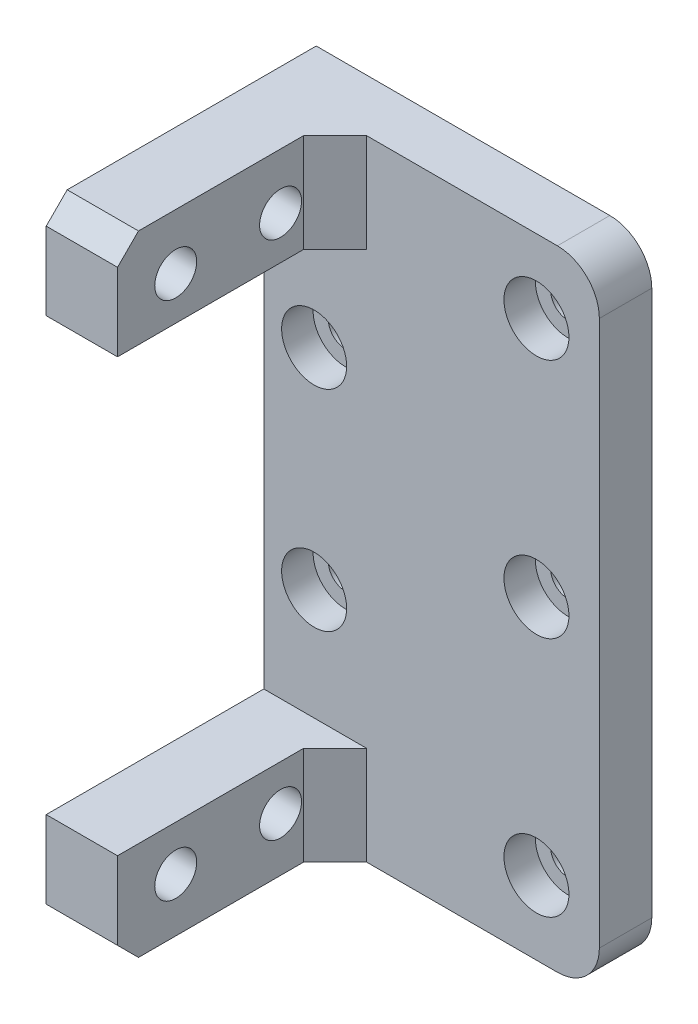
ISO-10303-21;
HEADER;
FILE_DESCRIPTION(('STEP AP214'),'2;1');
FILE_NAME('part.step','',(''),(''),'','','');
FILE_SCHEMA(('AUTOMOTIVE_DESIGN { 1 0 10303 214 1 1 1 1 }'));
ENDSEC;
DATA;
#1=APPLICATION_CONTEXT('core data for automotive mechanical design processes');
#2=APPLICATION_PROTOCOL_DEFINITION('international standard','automotive_design',2000,#1);
#3=PRODUCT_CONTEXT('',#1,'mechanical');
#4=PRODUCT('Part','Part','',(#3));
#5=PRODUCT_RELATED_PRODUCT_CATEGORY('part','',(#4));
#6=PRODUCT_DEFINITION_FORMATION('','',#4);
#7=PRODUCT_DEFINITION_CONTEXT('part definition',#1,'design');
#8=PRODUCT_DEFINITION('design','',#6,#7);
#9=PRODUCT_DEFINITION_SHAPE('','',#8);
#10=(LENGTH_UNIT() NAMED_UNIT(*) SI_UNIT(.MILLI.,.METRE.));
#11=(NAMED_UNIT(*) PLANE_ANGLE_UNIT() SI_UNIT($,.RADIAN.));
#12=(NAMED_UNIT(*) SI_UNIT($,.STERADIAN.) SOLID_ANGLE_UNIT());
#13=UNCERTAINTY_MEASURE_WITH_UNIT(LENGTH_MEASURE(1.E-05),#10,'distance_accuracy_value','');
#14=(GEOMETRIC_REPRESENTATION_CONTEXT(3) GLOBAL_UNCERTAINTY_ASSIGNED_CONTEXT((#13)) GLOBAL_UNIT_ASSIGNED_CONTEXT((#10,
#11,#12)) REPRESENTATION_CONTEXT('',''));
#15=CARTESIAN_POINT('',(0.,0.,0.));
#16=DIRECTION('',(0.,0.,1.));
#17=DIRECTION('',(1.,0.,0.));
#18=AXIS2_PLACEMENT_3D('',#15,#16,#17);
#19=CARTESIAN_POINT('',(-10.7000000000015,0.,36.1517240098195));
#20=DIRECTION('',(-1.,0.,0.));
#21=DIRECTION('',(0.,-1.,0.));
#22=AXIS2_PLACEMENT_3D('',#19,#20,#21);
#23=PLANE('',#22);
#24=CARTESIAN_POINT('',(-10.7000000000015,-5.30000000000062,20.2000000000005));
#25=DIRECTION('',(-1.,0.,0.));
#26=DIRECTION('',(0.,0.,1.));
#27=AXIS2_PLACEMENT_3D('',#24,#25,#26);
#28=CIRCLE('',#27,2.);
#29=CARTESIAN_POINT('',(-10.7000000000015,-5.30000000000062,22.2000000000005));
#30=VERTEX_POINT('',#29);
#31=EDGE_CURVE('E356',#30,#30,#28,.F.);
#32=ORIENTED_EDGE('',*,*,#31,.F.);
#33=EDGE_LOOP('',(#32));
#34=FACE_BOUND('',#33,.T.);
#35=CARTESIAN_POINT('',(-10.7000000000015,-5.30000000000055,10.2000000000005));
#36=DIRECTION('',(-1.,0.,0.));
#37=DIRECTION('',(0.,0.,1.));
#38=AXIS2_PLACEMENT_3D('',#35,#36,#37);
#39=CIRCLE('',#38,2.);
#40=CARTESIAN_POINT('',(-10.7000000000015,-5.30000000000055,12.2000000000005));
#41=VERTEX_POINT('',#40);
#42=EDGE_CURVE('E363',#41,#41,#39,.F.);
#43=ORIENTED_EDGE('',*,*,#42,.F.);
#44=EDGE_LOOP('',(#43));
#45=FACE_BOUND('',#44,.T.);
#46=DIRECTION('',(0.,0.,-1.));
#47=VECTOR('',#46,1.);
#48=CARTESIAN_POINT('',(-10.7000000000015,-9.4,36.1517240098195));
#49=LINE('',#48,#47);
#50=CARTESIAN_POINT('',(-10.7000000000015,-9.4,25.7500000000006));
#51=VERTEX_POINT('',#50);
#52=CARTESIAN_POINT('',(-10.7000000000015,-9.4,8.00000000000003));
#53=VERTEX_POINT('',#52);
#54=EDGE_CURVE('E192',#51,#53,#49,.T.);
#55=ORIENTED_EDGE('',*,*,#54,.T.);
#56=DIRECTION('',(0.,1.,0.));
#57=VECTOR('',#56,1.);
#58=CARTESIAN_POINT('',(-10.7000000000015,5.39650789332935E-13,8.00000000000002));
#59=LINE('',#58,#57);
#60=CARTESIAN_POINT('',(-10.7000000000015,0.,8.00000000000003));
#61=VERTEX_POINT('',#60);
#62=EDGE_CURVE('E299',#53,#61,#59,.T.);
#63=ORIENTED_EDGE('',*,*,#62,.T.);
#64=DIRECTION('',(0.,0.,-1.));
#65=VECTOR('',#64,1.);
#66=CARTESIAN_POINT('',(-10.7000000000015,0.,36.1517240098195));
#67=LINE('',#66,#65);
#68=CARTESIAN_POINT('',(-10.7000000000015,0.,23.7500000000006));
#69=VERTEX_POINT('',#68);
#70=EDGE_CURVE('E189',#69,#61,#67,.T.);
#71=ORIENTED_EDGE('',*,*,#70,.F.);
#72=DIRECTION('',(0.,0.707106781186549,-0.707106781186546));
#73=VECTOR('',#72,1.);
#74=CARTESIAN_POINT('',(-10.7000000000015,5.41937071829E-13,23.7500000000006));
#75=LINE('',#74,#73);
#76=CARTESIAN_POINT('',(-10.7000000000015,-1.99999999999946,25.7500000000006));
#77=VERTEX_POINT('',#76);
#78=EDGE_CURVE('E277',#69,#77,#75,.F.);
#79=ORIENTED_EDGE('',*,*,#78,.T.);
#80=DIRECTION('',(0.,-1.,0.));
#81=VECTOR('',#80,1.);
#82=CARTESIAN_POINT('',(-10.7000000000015,0.,25.7500000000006));
#83=LINE('',#82,#81);
#84=EDGE_CURVE('E160',#77,#51,#83,.T.);
#85=ORIENTED_EDGE('',*,*,#84,.T.);
#86=EDGE_LOOP('',(#55,#63,#71,#79,#85));
#87=FACE_BOUND('',#86,.T.);
#88=ADVANCED_FACE('F35',(#34,#45,#87),#23,.F.);
#89=CARTESIAN_POINT('',(-12.6999999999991,-19.9999999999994,-9.99999999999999));
#90=DIRECTION('',(0.,0.,1.));
#91=DIRECTION('',(1.,0.,0.));
#92=AXIS2_PLACEMENT_3D('',#89,#90,#91);
#93=CYLINDRICAL_SURFACE('',#92,1.65);
#94=CARTESIAN_POINT('',(-12.6999999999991,-19.9999999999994,0.));
#95=DIRECTION('',(0.,0.,-1.));
#96=DIRECTION('',(-1.,0.,0.));
#97=AXIS2_PLACEMENT_3D('',#94,#95,#96);
#98=CIRCLE('',#97,1.65);
#99=CARTESIAN_POINT('',(-14.3499999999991,-19.9999999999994,0.));
#100=VERTEX_POINT('',#99);
#101=EDGE_CURVE('E224',#100,#100,#98,.T.);
#102=ORIENTED_EDGE('',*,*,#101,.T.);
#103=EDGE_LOOP('',(#102));
#104=FACE_BOUND('',#103,.T.);
#105=CARTESIAN_POINT('',(-12.6999999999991,-19.9999999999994,2.));
#106=DIRECTION('',(0.,0.,1.));
#107=DIRECTION('',(1.,0.,0.));
#108=AXIS2_PLACEMENT_3D('',#105,#106,#107);
#109=CIRCLE('',#108,1.65);
#110=CARTESIAN_POINT('',(-11.0499999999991,-19.9999999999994,2.));
#111=VERTEX_POINT('',#110);
#112=EDGE_CURVE('E228',#111,#111,#109,.F.);
#113=ORIENTED_EDGE('',*,*,#112,.F.);
#114=EDGE_LOOP('',(#113));
#115=FACE_BOUND('',#114,.T.);
#116=ADVANCED_FACE('F393',(#104,#115),#93,.F.);
#117=CARTESIAN_POINT('',(8.49999999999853,-29.9999999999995,-9.99999999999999));
#118=DIRECTION('',(0.,0.,1.));
#119=DIRECTION('',(1.,0.,0.));
#120=AXIS2_PLACEMENT_3D('',#117,#118,#119);
#121=CYLINDRICAL_SURFACE('',#120,1.65);
#122=CARTESIAN_POINT('',(8.49999999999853,-29.9999999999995,0.));
#123=DIRECTION('',(0.,0.,-1.));
#124=DIRECTION('',(-1.,0.,0.));
#125=AXIS2_PLACEMENT_3D('',#122,#123,#124);
#126=CIRCLE('',#125,1.65);
#127=CARTESIAN_POINT('',(6.84999999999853,-29.9999999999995,0.));
#128=VERTEX_POINT('',#127);
#129=EDGE_CURVE('E227',#128,#128,#126,.T.);
#130=ORIENTED_EDGE('',*,*,#129,.T.);
#131=EDGE_LOOP('',(#130));
#132=FACE_BOUND('',#131,.T.);
#133=CARTESIAN_POINT('',(8.49999999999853,-29.9999999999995,2.));
#134=DIRECTION('',(0.,0.,1.));
#135=DIRECTION('',(1.,0.,0.));
#136=AXIS2_PLACEMENT_3D('',#133,#134,#135);
#137=CIRCLE('',#136,1.65);
#138=CARTESIAN_POINT('',(10.1499999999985,-29.9999999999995,2.));
#139=VERTEX_POINT('',#138);
#140=EDGE_CURVE('E270',#139,#139,#137,.F.);
#141=ORIENTED_EDGE('',*,*,#140,.F.);
#142=EDGE_LOOP('',(#141));
#143=FACE_BOUND('',#142,.T.);
#144=ADVANCED_FACE('F400',(#132,#143),#121,.F.);
#145=CARTESIAN_POINT('',(8.49999999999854,-52.9999999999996,-9.99999999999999));
#146=DIRECTION('',(0.,0.,1.));
#147=DIRECTION('',(1.,0.,0.));
#148=AXIS2_PLACEMENT_3D('',#145,#146,#147);
#149=CYLINDRICAL_SURFACE('',#148,1.65);
#150=CARTESIAN_POINT('',(8.49999999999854,-52.9999999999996,0.));
#151=DIRECTION('',(0.,0.,-1.));
#152=DIRECTION('',(-1.,0.,0.));
#153=AXIS2_PLACEMENT_3D('',#150,#151,#152);
#154=CIRCLE('',#153,1.65);
#155=CARTESIAN_POINT('',(6.84999999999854,-52.9999999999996,0.));
#156=VERTEX_POINT('',#155);
#157=EDGE_CURVE('E231',#156,#156,#154,.T.);
#158=ORIENTED_EDGE('',*,*,#157,.T.);
#159=EDGE_LOOP('',(#158));
#160=FACE_BOUND('',#159,.T.);
#161=CARTESIAN_POINT('',(8.49999999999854,-52.9999999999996,2.));
#162=DIRECTION('',(0.,0.,1.));
#163=DIRECTION('',(1.,0.,0.));
#164=AXIS2_PLACEMENT_3D('',#161,#162,#163);
#165=CIRCLE('',#164,1.65);
#166=CARTESIAN_POINT('',(10.1499999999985,-52.9999999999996,2.));
#167=VERTEX_POINT('',#166);
#168=EDGE_CURVE('E267',#167,#167,#165,.F.);
#169=ORIENTED_EDGE('',*,*,#168,.F.);
#170=EDGE_LOOP('',(#169));
#171=FACE_BOUND('',#170,.T.);
#172=ADVANCED_FACE('F441',(#160,#171),#149,.F.);
#173=CARTESIAN_POINT('',(8.49999999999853,-6.99999999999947,-9.99999999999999));
#174=DIRECTION('',(0.,0.,1.));
#175=DIRECTION('',(1.,0.,0.));
#176=AXIS2_PLACEMENT_3D('',#173,#174,#175);
#177=CYLINDRICAL_SURFACE('',#176,1.65);
#178=CARTESIAN_POINT('',(8.49999999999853,-6.99999999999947,0.));
#179=DIRECTION('',(0.,0.,-1.));
#180=DIRECTION('',(-1.,0.,0.));
#181=AXIS2_PLACEMENT_3D('',#178,#179,#180);
#182=CIRCLE('',#181,1.65);
#183=CARTESIAN_POINT('',(6.84999999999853,-6.99999999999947,0.));
#184=VERTEX_POINT('',#183);
#185=EDGE_CURVE('E234',#184,#184,#182,.T.);
#186=ORIENTED_EDGE('',*,*,#185,.T.);
#187=EDGE_LOOP('',(#186));
#188=FACE_BOUND('',#187,.T.);
#189=CARTESIAN_POINT('',(8.49999999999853,-6.99999999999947,2.));
#190=DIRECTION('',(0.,0.,1.));
#191=DIRECTION('',(1.,0.,0.));
#192=AXIS2_PLACEMENT_3D('',#189,#190,#191);
#193=CIRCLE('',#192,1.65);
#194=CARTESIAN_POINT('',(10.1499999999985,-6.99999999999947,2.));
#195=VERTEX_POINT('',#194);
#196=EDGE_CURVE('E263',#195,#195,#193,.F.);
#197=ORIENTED_EDGE('',*,*,#196,.F.);
#198=EDGE_LOOP('',(#197));
#199=FACE_BOUND('',#198,.T.);
#200=ADVANCED_FACE('F437',(#188,#199),#177,.F.);
#201=CARTESIAN_POINT('',(-12.6999999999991,-39.9999999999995,-9.99999999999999));
#202=DIRECTION('',(0.,0.,1.));
#203=DIRECTION('',(1.,0.,0.));
#204=AXIS2_PLACEMENT_3D('',#201,#202,#203);
#205=CYLINDRICAL_SURFACE('',#204,1.65);
#206=CARTESIAN_POINT('',(-12.6999999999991,-39.9999999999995,0.));
#207=DIRECTION('',(0.,0.,-1.));
#208=DIRECTION('',(-1.,0.,0.));
#209=AXIS2_PLACEMENT_3D('',#206,#207,#208);
#210=CIRCLE('',#209,1.65);
#211=CARTESIAN_POINT('',(-14.3499999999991,-39.9999999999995,0.));
#212=VERTEX_POINT('',#211);
#213=EDGE_CURVE('E237',#212,#212,#210,.T.);
#214=ORIENTED_EDGE('',*,*,#213,.T.);
#215=EDGE_LOOP('',(#214));
#216=FACE_BOUND('',#215,.T.);
#217=CARTESIAN_POINT('',(-12.6999999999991,-39.9999999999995,2.));
#218=DIRECTION('',(0.,0.,1.));
#219=DIRECTION('',(1.,0.,0.));
#220=AXIS2_PLACEMENT_3D('',#217,#218,#219);
#221=CIRCLE('',#220,1.65);
#222=CARTESIAN_POINT('',(-11.0499999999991,-39.9999999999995,2.));
#223=VERTEX_POINT('',#222);
#224=EDGE_CURVE('E260',#223,#223,#221,.F.);
#225=ORIENTED_EDGE('',*,*,#224,.F.);
#226=EDGE_LOOP('',(#225));
#227=FACE_BOUND('',#226,.T.);
#228=ADVANCED_FACE('F440',(#216,#227),#205,.F.);
#229=CARTESIAN_POINT('',(0.,0.,5.));
#230=DIRECTION('',(0.,0.,-1.));
#231=DIRECTION('',(-1.,0.,0.));
#232=AXIS2_PLACEMENT_3D('',#229,#230,#231);
#233=PLANE('',#232);
#234=CARTESIAN_POINT('',(8.49999999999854,-52.9999999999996,5.));
#235=DIRECTION('',(0.,0.,1.));
#236=DIRECTION('',(1.,0.,0.));
#237=AXIS2_PLACEMENT_3D('',#234,#235,#236);
#238=CIRCLE('',#237,3.1);
#239=CARTESIAN_POINT('',(11.5999999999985,-52.9999999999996,5.));
#240=VERTEX_POINT('',#239);
#241=EDGE_CURVE('E320',#240,#240,#238,.T.);
#242=ORIENTED_EDGE('',*,*,#241,.F.);
#243=EDGE_LOOP('',(#242));
#244=FACE_BOUND('',#243,.T.);
#245=CARTESIAN_POINT('',(-12.6999999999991,-39.9999999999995,5.));
#246=DIRECTION('',(0.,0.,1.));
#247=DIRECTION('',(1.,0.,0.));
#248=AXIS2_PLACEMENT_3D('',#245,#246,#247);
#249=CIRCLE('',#248,3.1);
#250=CARTESIAN_POINT('',(-9.59999999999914,-39.9999999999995,5.));
#251=VERTEX_POINT('',#250);
#252=EDGE_CURVE('E343',#251,#251,#249,.T.);
#253=ORIENTED_EDGE('',*,*,#252,.F.);
#254=EDGE_LOOP('',(#253));
#255=FACE_BOUND('',#254,.T.);
#256=CARTESIAN_POINT('',(8.49999999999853,-29.9999999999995,5.));
#257=DIRECTION('',(0.,0.,1.));
#258=DIRECTION('',(1.,0.,0.));
#259=AXIS2_PLACEMENT_3D('',#256,#257,#258);
#260=CIRCLE('',#259,3.1);
#261=CARTESIAN_POINT('',(11.5999999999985,-29.9999999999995,5.));
#262=VERTEX_POINT('',#261);
#263=EDGE_CURVE('E337',#262,#262,#260,.T.);
#264=ORIENTED_EDGE('',*,*,#263,.F.);
#265=EDGE_LOOP('',(#264));
#266=FACE_BOUND('',#265,.T.);
#267=CARTESIAN_POINT('',(8.49999999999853,-6.99999999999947,5.));
#268=DIRECTION('',(0.,0.,1.));
#269=DIRECTION('',(1.,0.,0.));
#270=AXIS2_PLACEMENT_3D('',#267,#268,#269);
#271=CIRCLE('',#270,3.1);
#272=CARTESIAN_POINT('',(11.5999999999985,-6.99999999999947,5.));
#273=VERTEX_POINT('',#272);
#274=EDGE_CURVE('E331',#273,#273,#271,.T.);
#275=ORIENTED_EDGE('',*,*,#274,.F.);
#276=EDGE_LOOP('',(#275));
#277=FACE_BOUND('',#276,.T.);
#278=CARTESIAN_POINT('',(-12.6999999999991,-19.9999999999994,5.));
#279=DIRECTION('',(0.,0.,1.));
#280=DIRECTION('',(1.,0.,0.));
#281=AXIS2_PLACEMENT_3D('',#278,#279,#280);
#282=CIRCLE('',#281,3.1);
#283=CARTESIAN_POINT('',(-9.59999999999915,-19.9999999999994,5.));
#284=VERTEX_POINT('',#283);
#285=EDGE_CURVE('E330',#284,#284,#282,.T.);
#286=ORIENTED_EDGE('',*,*,#285,.F.);
#287=EDGE_LOOP('',(#286));
#288=FACE_BOUND('',#287,.T.);
#289=DIRECTION('',(-1.,0.,0.));
#290=VECTOR('',#289,1.);
#291=CARTESIAN_POINT('',(-17.5000000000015,-50.5999999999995,5.));
#292=LINE('',#291,#290);
#293=CARTESIAN_POINT('',(-7.70000000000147,-50.5999999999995,5.));
#294=VERTEX_POINT('',#293);
#295=CARTESIAN_POINT('',(-17.5000000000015,-50.5999999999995,5.));
#296=VERTEX_POINT('',#295);
#297=EDGE_CURVE('E176',#294,#296,#292,.T.);
#298=ORIENTED_EDGE('',*,*,#297,.F.);
#299=DIRECTION('',(0.,-1.,0.));
#300=VECTOR('',#299,1.);
#301=CARTESIAN_POINT('',(-7.70000000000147,-59.9999999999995,5.));
#302=LINE('',#301,#300);
#303=CARTESIAN_POINT('',(-7.70000000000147,-59.9999999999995,5.));
#304=VERTEX_POINT('',#303);
#305=EDGE_CURVE('E297',#294,#304,#302,.T.);
#306=ORIENTED_EDGE('',*,*,#305,.T.);
#307=DIRECTION('',(1.,0.,0.));
#308=VECTOR('',#307,1.);
#309=CARTESIAN_POINT('',(-17.5000000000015,-59.9999999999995,5.));
#310=LINE('',#309,#308);
#311=CARTESIAN_POINT('',(10.4999999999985,-59.9999999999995,5.));
#312=VERTEX_POINT('',#311);
#313=EDGE_CURVE('E200',#304,#312,#310,.T.);
#314=ORIENTED_EDGE('',*,*,#313,.T.);
#315=CARTESIAN_POINT('',(10.4999999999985,-55.9999999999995,5.));
#316=DIRECTION('',(0.,0.,-1.));
#317=DIRECTION('',(-1.,0.,0.));
#318=AXIS2_PLACEMENT_3D('',#315,#316,#317);
#319=CIRCLE('',#318,4.);
#320=CARTESIAN_POINT('',(14.4999999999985,-55.9999999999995,5.));
#321=VERTEX_POINT('',#320);
#322=EDGE_CURVE('E252',#312,#321,#319,.F.);
#323=ORIENTED_EDGE('',*,*,#322,.T.);
#324=DIRECTION('',(0.,1.,0.));
#325=VECTOR('',#324,1.);
#326=CARTESIAN_POINT('',(14.4999999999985,-59.9999999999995,5.));
#327=LINE('',#326,#325);
#328=CARTESIAN_POINT('',(14.4999999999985,-3.99999999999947,5.));
#329=VERTEX_POINT('',#328);
#330=EDGE_CURVE('E203',#321,#329,#327,.T.);
#331=ORIENTED_EDGE('',*,*,#330,.T.);
#332=CARTESIAN_POINT('',(10.4999999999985,-3.99999999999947,5.));
#333=DIRECTION('',(0.,0.,-1.));
#334=DIRECTION('',(-1.,0.,0.));
#335=AXIS2_PLACEMENT_3D('',#332,#333,#334);
#336=CIRCLE('',#335,4.);
#337=CARTESIAN_POINT('',(10.4999999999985,5.29307500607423E-13,5.));
#338=VERTEX_POINT('',#337);
#339=EDGE_CURVE('E254',#329,#338,#336,.F.);
#340=ORIENTED_EDGE('',*,*,#339,.T.);
#341=DIRECTION('',(-1.,0.,0.));
#342=VECTOR('',#341,1.);
#343=CARTESIAN_POINT('',(-17.5000000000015,5.42968447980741E-13,5.));
#344=LINE('',#343,#342);
#345=CARTESIAN_POINT('',(-7.70000000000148,5.3818711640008E-13,5.));
#346=VERTEX_POINT('',#345);
#347=EDGE_CURVE('E206',#338,#346,#344,.T.);
#348=ORIENTED_EDGE('',*,*,#347,.T.);
#349=DIRECTION('',(0.,-1.,0.));
#350=VECTOR('',#349,1.);
#351=CARTESIAN_POINT('',(-7.70000000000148,-9.4,5.));
#352=LINE('',#351,#350);
#353=CARTESIAN_POINT('',(-7.70000000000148,-9.4,5.));
#354=VERTEX_POINT('',#353);
#355=EDGE_CURVE('E294',#346,#354,#352,.T.);
#356=ORIENTED_EDGE('',*,*,#355,.T.);
#357=DIRECTION('',(1.,0.,0.));
#358=VECTOR('',#357,1.);
#359=CARTESIAN_POINT('',(-17.5000000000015,-9.4,5.));
#360=LINE('',#359,#358);
#361=CARTESIAN_POINT('',(-17.5000000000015,-9.4,5.));
#362=VERTEX_POINT('',#361);
#363=EDGE_CURVE('E187',#362,#354,#360,.T.);
#364=ORIENTED_EDGE('',*,*,#363,.F.);
#365=DIRECTION('',(0.,-1.,0.));
#366=VECTOR('',#365,1.);
#367=CARTESIAN_POINT('',(-17.5000000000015,-59.9999999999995,5.));
#368=LINE('',#367,#366);
#369=EDGE_CURVE('E198',#362,#296,#368,.T.);
#370=ORIENTED_EDGE('',*,*,#369,.T.);
#371=EDGE_LOOP('',(#298,#306,#314,#323,#331,#340,#348,#356,#364,#370));
#372=FACE_BOUND('',#371,.T.);
#373=ADVANCED_FACE('F311',(#244,#255,#266,#277,#288,#372),#233,.F.);
#374=CARTESIAN_POINT('',(-17.5000000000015,-59.9999999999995,5.));
#375=DIRECTION('',(1.,0.,0.));
#376=DIRECTION('',(0.,0.,-1.));
#377=AXIS2_PLACEMENT_3D('',#374,#375,#376);
#378=PLANE('',#377);
#379=DIRECTION('',(0.,-1.,0.));
#380=VECTOR('',#379,1.);
#381=CARTESIAN_POINT('',(-17.5000000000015,-59.9999999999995,25.7500000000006));
#382=LINE('',#381,#380);
#383=CARTESIAN_POINT('',(-17.5000000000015,-1.99999999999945,25.7500000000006));
#384=VERTEX_POINT('',#383);
#385=CARTESIAN_POINT('',(-17.5000000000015,-9.4,25.7500000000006));
#386=VERTEX_POINT('',#385);
#387=EDGE_CURVE('E172',#384,#386,#382,.T.);
#388=ORIENTED_EDGE('',*,*,#387,.F.);
#389=DIRECTION('',(0.,-0.707106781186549,0.707106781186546));
#390=VECTOR('',#389,1.);
#391=CARTESIAN_POINT('',(-17.5000000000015,5.42968447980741E-13,23.7500000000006));
#392=LINE('',#391,#390);
#393=CARTESIAN_POINT('',(-17.5000000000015,5.42968447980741E-13,23.7500000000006));
#394=VERTEX_POINT('',#393);
#395=EDGE_CURVE('E282',#384,#394,#392,.F.);
#396=ORIENTED_EDGE('',*,*,#395,.T.);
#397=DIRECTION('',(0.,0.,-1.));
#398=VECTOR('',#397,1.);
#399=CARTESIAN_POINT('',(-17.5000000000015,5.42968447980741E-13,5.));
#400=LINE('',#399,#398);
#401=CARTESIAN_POINT('',(-17.5000000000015,5.42968447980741E-13,0.));
#402=VERTEX_POINT('',#401);
#403=EDGE_CURVE('E209',#394,#402,#400,.T.);
#404=ORIENTED_EDGE('',*,*,#403,.T.);
#405=DIRECTION('',(0.,-1.,0.));
#406=VECTOR('',#405,1.);
#407=CARTESIAN_POINT('',(-17.5000000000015,-59.9999999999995,0.));
#408=LINE('',#407,#406);
#409=CARTESIAN_POINT('',(-17.5000000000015,-59.9999999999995,0.));
#410=VERTEX_POINT('',#409);
#411=EDGE_CURVE('E197',#402,#410,#408,.T.);
#412=ORIENTED_EDGE('',*,*,#411,.T.);
#413=DIRECTION('',(0.,0.,-1.));
#414=VECTOR('',#413,1.);
#415=CARTESIAN_POINT('',(-17.5000000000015,-59.9999999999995,5.));
#416=LINE('',#415,#414);
#417=CARTESIAN_POINT('',(-17.5000000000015,-59.9999999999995,23.7500000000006));
#418=VERTEX_POINT('',#417);
#419=EDGE_CURVE('E221',#418,#410,#416,.T.);
#420=ORIENTED_EDGE('',*,*,#419,.F.);
#421=DIRECTION('',(0.,-0.707106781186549,-0.707106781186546));
#422=VECTOR('',#421,1.);
#423=CARTESIAN_POINT('',(-17.5000000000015,-59.9999999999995,23.7500000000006));
#424=LINE('',#423,#422);
#425=CARTESIAN_POINT('',(-17.5000000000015,-57.9999999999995,25.7500000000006));
#426=VERTEX_POINT('',#425);
#427=EDGE_CURVE('E171',#418,#426,#424,.F.);
#428=ORIENTED_EDGE('',*,*,#427,.T.);
#429=CARTESIAN_POINT('',(-17.5000000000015,-50.5999999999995,25.7500000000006));
#430=VERTEX_POINT('',#429);
#431=EDGE_CURVE('E151',#430,#426,#382,.T.);
#432=ORIENTED_EDGE('',*,*,#431,.F.);
#433=DIRECTION('',(0.,0.,-1.));
#434=VECTOR('',#433,1.);
#435=CARTESIAN_POINT('',(-17.5000000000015,-50.5999999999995,36.1517240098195));
#436=LINE('',#435,#434);
#437=EDGE_CURVE('E168',#430,#296,#436,.T.);
#438=ORIENTED_EDGE('',*,*,#437,.T.);
#439=ORIENTED_EDGE('',*,*,#369,.F.);
#440=DIRECTION('',(0.,0.,-1.));
#441=VECTOR('',#440,1.);
#442=CARTESIAN_POINT('',(-17.5000000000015,-9.4,36.1517240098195));
#443=LINE('',#442,#441);
#444=EDGE_CURVE('E194',#386,#362,#443,.T.);
#445=ORIENTED_EDGE('',*,*,#444,.F.);
#446=EDGE_LOOP('',(#388,#396,#404,#412,#420,#428,#432,#438,#439,#445));
#447=FACE_BOUND('',#446,.T.);
#448=CARTESIAN_POINT('',(-17.5000000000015,-5.30000000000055,10.2000000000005));
#449=DIRECTION('',(-1.,0.,0.));
#450=DIRECTION('',(0.,0.,1.));
#451=AXIS2_PLACEMENT_3D('',#448,#449,#450);
#452=CIRCLE('',#451,2.);
#453=CARTESIAN_POINT('',(-17.5000000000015,-5.30000000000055,12.2000000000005));
#454=VERTEX_POINT('',#453);
#455=EDGE_CURVE('E240',#454,#454,#452,.T.);
#456=ORIENTED_EDGE('',*,*,#455,.F.);
#457=EDGE_LOOP('',(#456));
#458=FACE_BOUND('',#457,.T.);
#459=CARTESIAN_POINT('',(-17.5000000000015,-5.30000000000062,20.2000000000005));
#460=DIRECTION('',(-1.,0.,0.));
#461=DIRECTION('',(0.,0.,1.));
#462=AXIS2_PLACEMENT_3D('',#459,#460,#461);
#463=CIRCLE('',#462,2.);
#464=CARTESIAN_POINT('',(-17.5000000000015,-5.30000000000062,22.2000000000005));
#465=VERTEX_POINT('',#464);
#466=EDGE_CURVE('E360',#465,#465,#463,.T.);
#467=ORIENTED_EDGE('',*,*,#466,.F.);
#468=EDGE_LOOP('',(#467));
#469=FACE_BOUND('',#468,.T.);
#470=CARTESIAN_POINT('',(-17.5000000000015,-54.9000000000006,20.2000000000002));
#471=DIRECTION('',(-1.,0.,0.));
#472=DIRECTION('',(0.,0.,1.));
#473=AXIS2_PLACEMENT_3D('',#470,#471,#472);
#474=CIRCLE('',#473,2.);
#475=CARTESIAN_POINT('',(-17.5000000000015,-54.9000000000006,22.2000000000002));
#476=VERTEX_POINT('',#475);
#477=EDGE_CURVE('E352',#476,#476,#474,.T.);
#478=ORIENTED_EDGE('',*,*,#477,.F.);
#479=EDGE_LOOP('',(#478));
#480=FACE_BOUND('',#479,.T.);
#481=CARTESIAN_POINT('',(-17.5000000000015,-54.9000000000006,10.2000000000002));
#482=DIRECTION('',(-1.,0.,0.));
#483=DIRECTION('',(0.,0.,1.));
#484=AXIS2_PLACEMENT_3D('',#481,#482,#483);
#485=CIRCLE('',#484,2.);
#486=CARTESIAN_POINT('',(-17.5000000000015,-54.9000000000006,12.2000000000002));
#487=VERTEX_POINT('',#486);
#488=EDGE_CURVE('E359',#487,#487,#485,.T.);
#489=ORIENTED_EDGE('',*,*,#488,.F.);
#490=EDGE_LOOP('',(#489));
#491=FACE_BOUND('',#490,.T.);
#492=ADVANCED_FACE('F165',(#447,#458,#469,#480,#491),#378,.F.);
#493=CARTESIAN_POINT('',(-17.5000000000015,-59.9999999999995,5.));
#494=DIRECTION('',(0.,1.,0.));
#495=DIRECTION('',(-1.,0.,0.));
#496=AXIS2_PLACEMENT_3D('',#493,#494,#495);
#497=PLANE('',#496);
#498=DIRECTION('',(0.,0.,-1.));
#499=VECTOR('',#498,1.);
#500=CARTESIAN_POINT('',(-10.7000000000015,-59.9999999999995,36.1517240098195));
#501=LINE('',#500,#499);
#502=CARTESIAN_POINT('',(-10.7000000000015,-59.9999999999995,23.7500000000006));
#503=VERTEX_POINT('',#502);
#504=CARTESIAN_POINT('',(-10.7000000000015,-59.9999999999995,8.00000000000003));
#505=VERTEX_POINT('',#504);
#506=EDGE_CURVE('E179',#503,#505,#501,.T.);
#507=ORIENTED_EDGE('',*,*,#506,.F.);
#508=DIRECTION('',(-1.,0.,0.));
#509=VECTOR('',#508,1.);
#510=CARTESIAN_POINT('',(-17.5000000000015,-59.9999999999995,23.7500000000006));
#511=LINE('',#510,#509);
#512=EDGE_CURVE('E284',#503,#418,#511,.T.);
#513=ORIENTED_EDGE('',*,*,#512,.T.);
#514=ORIENTED_EDGE('',*,*,#419,.T.);
#515=DIRECTION('',(1.,0.,0.));
#516=VECTOR('',#515,1.);
#517=CARTESIAN_POINT('',(-17.5000000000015,-59.9999999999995,0.));
#518=LINE('',#517,#516);
#519=CARTESIAN_POINT('',(10.4999999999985,-59.9999999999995,0.));
#520=VERTEX_POINT('',#519);
#521=EDGE_CURVE('E212',#410,#520,#518,.T.);
#522=ORIENTED_EDGE('',*,*,#521,.T.);
#523=DIRECTION('',(0.,0.,-1.));
#524=VECTOR('',#523,1.);
#525=CARTESIAN_POINT('',(10.4999999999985,-59.9999999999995,5.));
#526=LINE('',#525,#524);
#527=EDGE_CURVE('E256',#520,#312,#526,.F.);
#528=ORIENTED_EDGE('',*,*,#527,.T.);
#529=ORIENTED_EDGE('',*,*,#313,.F.);
#530=DIRECTION('',(0.707106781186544,0.,-0.707106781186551));
#531=VECTOR('',#530,1.);
#532=CARTESIAN_POINT('',(-12.6000000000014,-59.9999999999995,9.9));
#533=LINE('',#532,#531);
#534=EDGE_CURVE('E303',#304,#505,#533,.F.);
#535=ORIENTED_EDGE('',*,*,#534,.T.);
#536=EDGE_LOOP('',(#507,#513,#514,#522,#528,#529,#535));
#537=FACE_BOUND('',#536,.T.);
#538=ADVANCED_FACE('F416',(#537),#497,.F.);
#539=CARTESIAN_POINT('',(14.4999999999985,-59.9999999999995,5.));
#540=DIRECTION('',(-1.,0.,0.));
#541=DIRECTION('',(0.,0.,1.));
#542=AXIS2_PLACEMENT_3D('',#539,#540,#541);
#543=PLANE('',#542);
#544=DIRECTION('',(0.,1.,0.));
#545=VECTOR('',#544,1.);
#546=CARTESIAN_POINT('',(14.4999999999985,-59.9999999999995,0.));
#547=LINE('',#546,#545);
#548=CARTESIAN_POINT('',(14.4999999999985,-55.9999999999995,0.));
#549=VERTEX_POINT('',#548);
#550=CARTESIAN_POINT('',(14.4999999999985,-3.99999999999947,0.));
#551=VERTEX_POINT('',#550);
#552=EDGE_CURVE('E215',#549,#551,#547,.T.);
#553=ORIENTED_EDGE('',*,*,#552,.T.);
#554=DIRECTION('',(0.,0.,-1.));
#555=VECTOR('',#554,1.);
#556=CARTESIAN_POINT('',(14.4999999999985,-3.99999999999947,5.));
#557=LINE('',#556,#555);
#558=EDGE_CURVE('E250',#551,#329,#557,.F.);
#559=ORIENTED_EDGE('',*,*,#558,.T.);
#560=ORIENTED_EDGE('',*,*,#330,.F.);
#561=DIRECTION('',(0.,0.,-1.));
#562=VECTOR('',#561,1.);
#563=CARTESIAN_POINT('',(14.4999999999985,-55.9999999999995,5.));
#564=LINE('',#563,#562);
#565=EDGE_CURVE('E247',#321,#549,#564,.T.);
#566=ORIENTED_EDGE('',*,*,#565,.T.);
#567=EDGE_LOOP('',(#553,#559,#560,#566));
#568=FACE_BOUND('',#567,.T.);
#569=ADVANCED_FACE('F527',(#568),#543,.F.);
#570=CARTESIAN_POINT('',(-17.5000000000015,5.42968447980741E-13,5.));
#571=DIRECTION('',(0.,-1.,0.));
#572=DIRECTION('',(1.,0.,0.));
#573=AXIS2_PLACEMENT_3D('',#570,#571,#572);
#574=PLANE('',#573);
#575=ORIENTED_EDGE('',*,*,#403,.F.);
#576=DIRECTION('',(1.,0.,0.));
#577=VECTOR('',#576,1.);
#578=CARTESIAN_POINT('',(-17.5000000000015,5.42968447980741E-13,23.7500000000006));
#579=LINE('',#578,#577);
#580=EDGE_CURVE('E259',#394,#69,#579,.T.);
#581=ORIENTED_EDGE('',*,*,#580,.T.);
#582=ORIENTED_EDGE('',*,*,#70,.T.);
#583=DIRECTION('',(-0.707106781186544,0.,0.707106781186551));
#584=VECTOR('',#583,1.);
#585=CARTESIAN_POINT('',(-12.6000000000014,5.4057778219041E-13,9.9));
#586=LINE('',#585,#584);
#587=EDGE_CURVE('E44',#61,#346,#586,.F.);
#588=ORIENTED_EDGE('',*,*,#587,.T.);
#589=ORIENTED_EDGE('',*,*,#347,.F.);
#590=DIRECTION('',(0.,0.,-1.));
#591=VECTOR('',#590,1.);
#592=CARTESIAN_POINT('',(10.4999999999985,5.29307500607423E-13,5.));
#593=LINE('',#592,#591);
#594=CARTESIAN_POINT('',(10.4999999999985,5.29307500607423E-13,0.));
#595=VERTEX_POINT('',#594);
#596=EDGE_CURVE('E223',#338,#595,#593,.T.);
#597=ORIENTED_EDGE('',*,*,#596,.T.);
#598=DIRECTION('',(-1.,0.,0.));
#599=VECTOR('',#598,1.);
#600=CARTESIAN_POINT('',(-17.5000000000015,5.42968447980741E-13,0.));
#601=LINE('',#600,#599);
#602=EDGE_CURVE('E201',#595,#402,#601,.T.);
#603=ORIENTED_EDGE('',*,*,#602,.T.);
#604=EDGE_LOOP('',(#575,#581,#582,#588,#589,#597,#603));
#605=FACE_BOUND('',#604,.T.);
#606=ADVANCED_FACE('F307',(#605),#574,.F.);
#607=CARTESIAN_POINT('',(0.,0.,0.));
#608=DIRECTION('',(0.,0.,-1.));
#609=DIRECTION('',(-1.,0.,0.));
#610=AXIS2_PLACEMENT_3D('',#607,#608,#609);
#611=PLANE('',#610);
#612=ORIENTED_EDGE('',*,*,#213,.F.);
#613=EDGE_LOOP('',(#612));
#614=FACE_BOUND('',#613,.T.);
#615=ORIENTED_EDGE('',*,*,#185,.F.);
#616=EDGE_LOOP('',(#615));
#617=FACE_BOUND('',#616,.T.);
#618=ORIENTED_EDGE('',*,*,#157,.F.);
#619=EDGE_LOOP('',(#618));
#620=FACE_BOUND('',#619,.T.);
#621=ORIENTED_EDGE('',*,*,#129,.F.);
#622=EDGE_LOOP('',(#621));
#623=FACE_BOUND('',#622,.T.);
#624=ORIENTED_EDGE('',*,*,#101,.F.);
#625=EDGE_LOOP('',(#624));
#626=FACE_BOUND('',#625,.T.);
#627=ORIENTED_EDGE('',*,*,#602,.F.);
#628=CARTESIAN_POINT('',(10.4999999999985,-3.99999999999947,0.));
#629=DIRECTION('',(0.,0.,-1.));
#630=DIRECTION('',(-1.,0.,0.));
#631=AXIS2_PLACEMENT_3D('',#628,#629,#630);
#632=CIRCLE('',#631,4.);
#633=EDGE_CURVE('E245',#595,#551,#632,.T.);
#634=ORIENTED_EDGE('',*,*,#633,.T.);
#635=ORIENTED_EDGE('',*,*,#552,.F.);
#636=CARTESIAN_POINT('',(10.4999999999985,-55.9999999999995,0.));
#637=DIRECTION('',(0.,0.,-1.));
#638=DIRECTION('',(-1.,0.,0.));
#639=AXIS2_PLACEMENT_3D('',#636,#637,#638);
#640=CIRCLE('',#639,4.);
#641=EDGE_CURVE('E243',#549,#520,#640,.T.);
#642=ORIENTED_EDGE('',*,*,#641,.T.);
#643=ORIENTED_EDGE('',*,*,#521,.F.);
#644=ORIENTED_EDGE('',*,*,#411,.F.);
#645=EDGE_LOOP('',(#627,#634,#635,#642,#643,#644));
#646=FACE_BOUND('',#645,.T.);
#647=ADVANCED_FACE('F379',(#614,#617,#620,#623,#626,#646),#611,.T.);
#648=ORIENTED_EDGE('',*,*,#506,.T.);
#649=DIRECTION('',(0.,1.,0.));
#650=VECTOR('',#649,1.);
#651=CARTESIAN_POINT('',(-10.7000000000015,-50.5999999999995,8.00000000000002));
#652=LINE('',#651,#650);
#653=CARTESIAN_POINT('',(-10.7000000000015,-50.5999999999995,8.00000000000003));
#654=VERTEX_POINT('',#653);
#655=EDGE_CURVE('E291',#505,#654,#652,.T.);
#656=ORIENTED_EDGE('',*,*,#655,.T.);
#657=DIRECTION('',(0.,0.,-1.));
#658=VECTOR('',#657,1.);
#659=CARTESIAN_POINT('',(-10.7000000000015,-50.5999999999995,36.1517240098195));
#660=LINE('',#659,#658);
#661=CARTESIAN_POINT('',(-10.7000000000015,-50.5999999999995,25.7500000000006));
#662=VERTEX_POINT('',#661);
#663=EDGE_CURVE('E177',#662,#654,#660,.T.);
#664=ORIENTED_EDGE('',*,*,#663,.F.);
#665=CARTESIAN_POINT('',(-10.7000000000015,-57.9999999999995,25.7500000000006));
#666=VERTEX_POINT('',#665);
#667=EDGE_CURVE('E154',#662,#666,#83,.T.);
#668=ORIENTED_EDGE('',*,*,#667,.T.);
#669=DIRECTION('',(0.,0.707106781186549,0.707106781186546));
#670=VECTOR('',#669,1.);
#671=CARTESIAN_POINT('',(-10.7000000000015,-59.9999999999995,23.7500000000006));
#672=LINE('',#671,#670);
#673=EDGE_CURVE('E289',#666,#503,#672,.F.);
#674=ORIENTED_EDGE('',*,*,#673,.T.);
#675=EDGE_LOOP('',(#648,#656,#664,#668,#674));
#676=FACE_BOUND('',#675,.T.);
#677=CARTESIAN_POINT('',(-10.7000000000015,-54.9000000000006,20.2000000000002));
#678=DIRECTION('',(-1.,0.,0.));
#679=DIRECTION('',(0.,0.,1.));
#680=AXIS2_PLACEMENT_3D('',#677,#678,#679);
#681=CIRCLE('',#680,2.);
#682=CARTESIAN_POINT('',(-10.7000000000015,-54.9000000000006,22.2000000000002));
#683=VERTEX_POINT('',#682);
#684=EDGE_CURVE('E355',#683,#683,#681,.F.);
#685=ORIENTED_EDGE('',*,*,#684,.F.);
#686=EDGE_LOOP('',(#685));
#687=FACE_BOUND('',#686,.T.);
#688=CARTESIAN_POINT('',(-10.7000000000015,-54.9000000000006,10.2000000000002));
#689=DIRECTION('',(-1.,0.,0.));
#690=DIRECTION('',(0.,0.,1.));
#691=AXIS2_PLACEMENT_3D('',#688,#689,#690);
#692=CIRCLE('',#691,2.);
#693=CARTESIAN_POINT('',(-10.7000000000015,-54.9000000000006,12.2000000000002));
#694=VERTEX_POINT('',#693);
#695=EDGE_CURVE('E181',#694,#694,#692,.F.);
#696=ORIENTED_EDGE('',*,*,#695,.F.);
#697=EDGE_LOOP('',(#696));
#698=FACE_BOUND('',#697,.T.);
#699=ADVANCED_FACE('F377',(#676,#687,#698),#23,.F.);
#700=CARTESIAN_POINT('',(-17.5000000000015,-9.4,36.1517240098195));
#701=DIRECTION('',(0.,1.,0.));
#702=DIRECTION('',(0.,0.,1.));
#703=AXIS2_PLACEMENT_3D('',#700,#701,#702);
#704=PLANE('',#703);
#705=ORIENTED_EDGE('',*,*,#54,.F.);
#706=DIRECTION('',(1.,0.,0.));
#707=VECTOR('',#706,1.);
#708=CARTESIAN_POINT('',(-17.5000000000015,-9.4,25.7500000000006));
#709=LINE('',#708,#707);
#710=EDGE_CURVE('E159',#386,#51,#709,.T.);
#711=ORIENTED_EDGE('',*,*,#710,.F.);
#712=ORIENTED_EDGE('',*,*,#444,.T.);
#713=ORIENTED_EDGE('',*,*,#363,.T.);
#714=DIRECTION('',(0.707106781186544,0.,-0.707106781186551));
#715=VECTOR('',#714,1.);
#716=CARTESIAN_POINT('',(-28.1758620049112,-9.4,25.4758620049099));
#717=LINE('',#716,#715);
#718=EDGE_CURVE('E11',#354,#53,#717,.F.);
#719=ORIENTED_EDGE('',*,*,#718,.T.);
#720=EDGE_LOOP('',(#705,#711,#712,#713,#719));
#721=FACE_BOUND('',#720,.T.);
#722=ADVANCED_FACE('F317',(#721),#704,.F.);
#723=CARTESIAN_POINT('',(-17.5000000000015,-50.5999999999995,36.1517240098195));
#724=DIRECTION('',(0.,-1.,0.));
#725=DIRECTION('',(0.,0.,-1.));
#726=AXIS2_PLACEMENT_3D('',#723,#724,#725);
#727=PLANE('',#726);
#728=ORIENTED_EDGE('',*,*,#437,.F.);
#729=DIRECTION('',(-1.,0.,0.));
#730=VECTOR('',#729,1.);
#731=CARTESIAN_POINT('',(-10.7000000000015,-50.5999999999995,25.7500000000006));
#732=LINE('',#731,#730);
#733=EDGE_CURVE('E148',#662,#430,#732,.T.);
#734=ORIENTED_EDGE('',*,*,#733,.F.);
#735=ORIENTED_EDGE('',*,*,#663,.T.);
#736=DIRECTION('',(-0.707106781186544,0.,0.707106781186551));
#737=VECTOR('',#736,1.);
#738=CARTESIAN_POINT('',(-28.1758620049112,-50.5999999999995,25.4758620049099));
#739=LINE('',#738,#737);
#740=EDGE_CURVE('E301',#654,#294,#739,.F.);
#741=ORIENTED_EDGE('',*,*,#740,.T.);
#742=ORIENTED_EDGE('',*,*,#297,.T.);
#743=EDGE_LOOP('',(#728,#734,#735,#741,#742));
#744=FACE_BOUND('',#743,.T.);
#745=ADVANCED_FACE('F174',(#744),#727,.F.);
#746=CARTESIAN_POINT('',(-5.04314575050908,-54.9000000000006,10.2000000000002));
#747=DIRECTION('',(-1.,0.,0.));
#748=DIRECTION('',(0.,0.,1.));
#749=AXIS2_PLACEMENT_3D('',#746,#747,#748);
#750=CYLINDRICAL_SURFACE('',#749,2.);
#751=ORIENTED_EDGE('',*,*,#695,.T.);
#752=EDGE_LOOP('',(#751));
#753=FACE_BOUND('',#752,.T.);
#754=ORIENTED_EDGE('',*,*,#488,.T.);
#755=EDGE_LOOP('',(#754));
#756=FACE_BOUND('',#755,.T.);
#757=ADVANCED_FACE('F374',(#753,#756),#750,.F.);
#758=CARTESIAN_POINT('',(-5.04314575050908,-54.9000000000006,20.2000000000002));
#759=DIRECTION('',(-1.,0.,0.));
#760=DIRECTION('',(0.,0.,1.));
#761=AXIS2_PLACEMENT_3D('',#758,#759,#760);
#762=CYLINDRICAL_SURFACE('',#761,2.);
#763=ORIENTED_EDGE('',*,*,#684,.T.);
#764=EDGE_LOOP('',(#763));
#765=FACE_BOUND('',#764,.T.);
#766=ORIENTED_EDGE('',*,*,#477,.T.);
#767=EDGE_LOOP('',(#766));
#768=FACE_BOUND('',#767,.T.);
#769=ADVANCED_FACE('F424',(#765,#768),#762,.F.);
#770=CARTESIAN_POINT('',(-5.04314575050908,-5.30000000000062,20.2000000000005));
#771=DIRECTION('',(-1.,0.,0.));
#772=DIRECTION('',(0.,0.,1.));
#773=AXIS2_PLACEMENT_3D('',#770,#771,#772);
#774=CYLINDRICAL_SURFACE('',#773,2.);
#775=ORIENTED_EDGE('',*,*,#31,.T.);
#776=EDGE_LOOP('',(#775));
#777=FACE_BOUND('',#776,.T.);
#778=ORIENTED_EDGE('',*,*,#466,.T.);
#779=EDGE_LOOP('',(#778));
#780=FACE_BOUND('',#779,.T.);
#781=ADVANCED_FACE('F411',(#777,#780),#774,.F.);
#782=CARTESIAN_POINT('',(-5.04314575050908,-5.30000000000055,10.2000000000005));
#783=DIRECTION('',(-1.,0.,0.));
#784=DIRECTION('',(0.,0.,1.));
#785=AXIS2_PLACEMENT_3D('',#782,#783,#784);
#786=CYLINDRICAL_SURFACE('',#785,2.);
#787=ORIENTED_EDGE('',*,*,#42,.T.);
#788=EDGE_LOOP('',(#787));
#789=FACE_BOUND('',#788,.T.);
#790=ORIENTED_EDGE('',*,*,#455,.T.);
#791=EDGE_LOOP('',(#790));
#792=FACE_BOUND('',#791,.T.);
#793=ADVANCED_FACE('F407',(#789,#792),#786,.F.);
#794=CARTESIAN_POINT('',(10.4999999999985,-3.99999999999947,5.));
#795=DIRECTION('',(0.,0.,-1.));
#796=DIRECTION('',(-1.,0.,0.));
#797=AXIS2_PLACEMENT_3D('',#794,#795,#796);
#798=CYLINDRICAL_SURFACE('',#797,4.);
#799=ORIENTED_EDGE('',*,*,#339,.F.);
#800=ORIENTED_EDGE('',*,*,#558,.F.);
#801=ORIENTED_EDGE('',*,*,#633,.F.);
#802=ORIENTED_EDGE('',*,*,#596,.F.);
#803=EDGE_LOOP('',(#799,#800,#801,#802));
#804=FACE_BOUND('',#803,.T.);
#805=ADVANCED_FACE('F410',(#804),#798,.T.);
#806=CARTESIAN_POINT('',(10.4999999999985,-55.9999999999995,5.));
#807=DIRECTION('',(0.,0.,-1.));
#808=DIRECTION('',(-1.,0.,0.));
#809=AXIS2_PLACEMENT_3D('',#806,#807,#808);
#810=CYLINDRICAL_SURFACE('',#809,4.);
#811=ORIENTED_EDGE('',*,*,#322,.F.);
#812=ORIENTED_EDGE('',*,*,#527,.F.);
#813=ORIENTED_EDGE('',*,*,#641,.F.);
#814=ORIENTED_EDGE('',*,*,#565,.F.);
#815=EDGE_LOOP('',(#811,#812,#813,#814));
#816=FACE_BOUND('',#815,.T.);
#817=ADVANCED_FACE('F479',(#816),#810,.T.);
#818=CARTESIAN_POINT('',(-12.6999999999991,-39.9999999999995,2.));
#819=DIRECTION('',(0.,0.,1.));
#820=DIRECTION('',(1.,0.,0.));
#821=AXIS2_PLACEMENT_3D('',#818,#819,#820);
#822=PLANE('',#821);
#823=CARTESIAN_POINT('',(-12.6999999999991,-39.9999999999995,2.));
#824=DIRECTION('',(0.,0.,1.));
#825=DIRECTION('',(1.,0.,0.));
#826=AXIS2_PLACEMENT_3D('',#823,#824,#825);
#827=CIRCLE('',#826,3.1);
#828=CARTESIAN_POINT('',(-9.59999999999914,-39.9999999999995,2.));
#829=VERTEX_POINT('',#828);
#830=EDGE_CURVE('E340',#829,#829,#827,.T.);
#831=ORIENTED_EDGE('',*,*,#830,.T.);
#832=EDGE_LOOP('',(#831));
#833=FACE_BOUND('',#832,.T.);
#834=ORIENTED_EDGE('',*,*,#224,.T.);
#835=EDGE_LOOP('',(#834));
#836=FACE_BOUND('',#835,.T.);
#837=ADVANCED_FACE('F475',(#833,#836),#822,.T.);
#838=CARTESIAN_POINT('',(-12.6999999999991,-39.9999999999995,2.));
#839=DIRECTION('',(0.,0.,1.));
#840=DIRECTION('',(1.,0.,0.));
#841=AXIS2_PLACEMENT_3D('',#838,#839,#840);
#842=CYLINDRICAL_SURFACE('',#841,3.1);
#843=ORIENTED_EDGE('',*,*,#830,.F.);
#844=EDGE_LOOP('',(#843));
#845=FACE_BOUND('',#844,.T.);
#846=ORIENTED_EDGE('',*,*,#252,.T.);
#847=EDGE_LOOP('',(#846));
#848=FACE_BOUND('',#847,.T.);
#849=ADVANCED_FACE('F471',(#845,#848),#842,.F.);
#850=CARTESIAN_POINT('',(8.49999999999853,-6.99999999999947,2.));
#851=DIRECTION('',(0.,0.,1.));
#852=DIRECTION('',(1.,0.,0.));
#853=AXIS2_PLACEMENT_3D('',#850,#851,#852);
#854=PLANE('',#853);
#855=CARTESIAN_POINT('',(8.49999999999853,-6.99999999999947,2.));
#856=DIRECTION('',(0.,0.,1.));
#857=DIRECTION('',(1.,0.,0.));
#858=AXIS2_PLACEMENT_3D('',#855,#856,#857);
#859=CIRCLE('',#858,3.1);
#860=CARTESIAN_POINT('',(11.5999999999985,-6.99999999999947,2.));
#861=VERTEX_POINT('',#860);
#862=EDGE_CURVE('E327',#861,#861,#859,.T.);
#863=ORIENTED_EDGE('',*,*,#862,.T.);
#864=EDGE_LOOP('',(#863));
#865=FACE_BOUND('',#864,.T.);
#866=ORIENTED_EDGE('',*,*,#196,.T.);
#867=EDGE_LOOP('',(#866));
#868=FACE_BOUND('',#867,.T.);
#869=ADVANCED_FACE('F474',(#865,#868),#854,.T.);
#870=CARTESIAN_POINT('',(8.49999999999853,-6.99999999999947,2.));
#871=DIRECTION('',(0.,0.,1.));
#872=DIRECTION('',(1.,0.,0.));
#873=AXIS2_PLACEMENT_3D('',#870,#871,#872);
#874=CYLINDRICAL_SURFACE('',#873,3.1);
#875=ORIENTED_EDGE('',*,*,#862,.F.);
#876=EDGE_LOOP('',(#875));
#877=FACE_BOUND('',#876,.T.);
#878=ORIENTED_EDGE('',*,*,#274,.T.);
#879=EDGE_LOOP('',(#878));
#880=FACE_BOUND('',#879,.T.);
#881=ADVANCED_FACE('F469',(#877,#880),#874,.F.);
#882=CARTESIAN_POINT('',(8.49999999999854,-52.9999999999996,2.));
#883=DIRECTION('',(0.,0.,1.));
#884=DIRECTION('',(1.,0.,0.));
#885=AXIS2_PLACEMENT_3D('',#882,#883,#884);
#886=PLANE('',#885);
#887=CARTESIAN_POINT('',(8.49999999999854,-52.9999999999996,2.));
#888=DIRECTION('',(0.,0.,1.));
#889=DIRECTION('',(1.,0.,0.));
#890=AXIS2_PLACEMENT_3D('',#887,#888,#889);
#891=CIRCLE('',#890,3.1);
#892=CARTESIAN_POINT('',(11.5999999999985,-52.9999999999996,2.));
#893=VERTEX_POINT('',#892);
#894=EDGE_CURVE('E323',#893,#893,#891,.T.);
#895=ORIENTED_EDGE('',*,*,#894,.T.);
#896=EDGE_LOOP('',(#895));
#897=FACE_BOUND('',#896,.T.);
#898=ORIENTED_EDGE('',*,*,#168,.T.);
#899=EDGE_LOOP('',(#898));
#900=FACE_BOUND('',#899,.T.);
#901=ADVANCED_FACE('F465',(#897,#900),#886,.T.);
#902=CARTESIAN_POINT('',(8.49999999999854,-52.9999999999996,2.));
#903=DIRECTION('',(0.,0.,1.));
#904=DIRECTION('',(1.,0.,0.));
#905=AXIS2_PLACEMENT_3D('',#902,#903,#904);
#906=CYLINDRICAL_SURFACE('',#905,3.1);
#907=ORIENTED_EDGE('',*,*,#894,.F.);
#908=EDGE_LOOP('',(#907));
#909=FACE_BOUND('',#908,.T.);
#910=ORIENTED_EDGE('',*,*,#241,.T.);
#911=EDGE_LOOP('',(#910));
#912=FACE_BOUND('',#911,.T.);
#913=ADVANCED_FACE('F461',(#909,#912),#906,.F.);
#914=CARTESIAN_POINT('',(8.49999999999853,-29.9999999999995,2.));
#915=DIRECTION('',(0.,0.,1.));
#916=DIRECTION('',(1.,0.,0.));
#917=AXIS2_PLACEMENT_3D('',#914,#915,#916);
#918=PLANE('',#917);
#919=CARTESIAN_POINT('',(8.49999999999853,-29.9999999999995,2.));
#920=DIRECTION('',(0.,0.,1.));
#921=DIRECTION('',(1.,0.,0.));
#922=AXIS2_PLACEMENT_3D('',#919,#920,#921);
#923=CIRCLE('',#922,3.1);
#924=CARTESIAN_POINT('',(11.5999999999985,-29.9999999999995,2.));
#925=VERTEX_POINT('',#924);
#926=EDGE_CURVE('E334',#925,#925,#923,.T.);
#927=ORIENTED_EDGE('',*,*,#926,.T.);
#928=EDGE_LOOP('',(#927));
#929=FACE_BOUND('',#928,.T.);
#930=ORIENTED_EDGE('',*,*,#140,.T.);
#931=EDGE_LOOP('',(#930));
#932=FACE_BOUND('',#931,.T.);
#933=ADVANCED_FACE('F464',(#929,#932),#918,.T.);
#934=CARTESIAN_POINT('',(8.49999999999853,-29.9999999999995,2.));
#935=DIRECTION('',(0.,0.,1.));
#936=DIRECTION('',(1.,0.,0.));
#937=AXIS2_PLACEMENT_3D('',#934,#935,#936);
#938=CYLINDRICAL_SURFACE('',#937,3.1);
#939=ORIENTED_EDGE('',*,*,#926,.F.);
#940=EDGE_LOOP('',(#939));
#941=FACE_BOUND('',#940,.T.);
#942=ORIENTED_EDGE('',*,*,#263,.T.);
#943=EDGE_LOOP('',(#942));
#944=FACE_BOUND('',#943,.T.);
#945=ADVANCED_FACE('F459',(#941,#944),#938,.F.);
#946=CARTESIAN_POINT('',(-12.6999999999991,-19.9999999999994,2.));
#947=DIRECTION('',(0.,0.,1.));
#948=DIRECTION('',(1.,0.,0.));
#949=AXIS2_PLACEMENT_3D('',#946,#947,#948);
#950=PLANE('',#949);
#951=CARTESIAN_POINT('',(-12.6999999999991,-19.9999999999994,2.));
#952=DIRECTION('',(0.,0.,1.));
#953=DIRECTION('',(1.,0.,0.));
#954=AXIS2_PLACEMENT_3D('',#951,#952,#953);
#955=CIRCLE('',#954,3.1);
#956=CARTESIAN_POINT('',(-9.59999999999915,-19.9999999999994,2.));
#957=VERTEX_POINT('',#956);
#958=EDGE_CURVE('E264',#957,#957,#955,.T.);
#959=ORIENTED_EDGE('',*,*,#958,.T.);
#960=EDGE_LOOP('',(#959));
#961=FACE_BOUND('',#960,.T.);
#962=ORIENTED_EDGE('',*,*,#112,.T.);
#963=EDGE_LOOP('',(#962));
#964=FACE_BOUND('',#963,.T.);
#965=ADVANCED_FACE('F455',(#961,#964),#950,.T.);
#966=CARTESIAN_POINT('',(-12.6999999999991,-19.9999999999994,2.));
#967=DIRECTION('',(0.,0.,1.));
#968=DIRECTION('',(1.,0.,0.));
#969=AXIS2_PLACEMENT_3D('',#966,#967,#968);
#970=CYLINDRICAL_SURFACE('',#969,3.1);
#971=ORIENTED_EDGE('',*,*,#958,.F.);
#972=EDGE_LOOP('',(#971));
#973=FACE_BOUND('',#972,.T.);
#974=ORIENTED_EDGE('',*,*,#285,.T.);
#975=EDGE_LOOP('',(#974));
#976=FACE_BOUND('',#975,.T.);
#977=ADVANCED_FACE('F452',(#973,#976),#970,.F.);
#978=CARTESIAN_POINT('',(-7.50000000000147,-59.9999999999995,25.7500000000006));
#979=DIRECTION('',(0.,0.,-1.));
#980=DIRECTION('',(-1.,0.,0.));
#981=AXIS2_PLACEMENT_3D('',#978,#979,#980);
#982=PLANE('',#981);
#983=ORIENTED_EDGE('',*,*,#431,.T.);
#984=DIRECTION('',(1.,0.,0.));
#985=VECTOR('',#984,1.);
#986=CARTESIAN_POINT('',(-7.50000000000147,-57.9999999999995,25.7500000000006));
#987=LINE('',#986,#985);
#988=EDGE_CURVE('E287',#426,#666,#987,.T.);
#989=ORIENTED_EDGE('',*,*,#988,.T.);
#990=ORIENTED_EDGE('',*,*,#667,.F.);
#991=ORIENTED_EDGE('',*,*,#733,.T.);
#992=EDGE_LOOP('',(#983,#989,#990,#991));
#993=FACE_BOUND('',#992,.T.);
#994=ADVANCED_FACE('F150',(#993),#982,.F.);
#995=ORIENTED_EDGE('',*,*,#84,.F.);
#996=DIRECTION('',(-1.,0.,0.));
#997=VECTOR('',#996,1.);
#998=CARTESIAN_POINT('',(-7.50000000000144,-1.99999999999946,25.7500000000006));
#999=LINE('',#998,#997);
#1000=EDGE_CURVE('E279',#77,#384,#999,.T.);
#1001=ORIENTED_EDGE('',*,*,#1000,.T.);
#1002=ORIENTED_EDGE('',*,*,#387,.T.);
#1003=ORIENTED_EDGE('',*,*,#710,.T.);
#1004=EDGE_LOOP('',(#995,#1001,#1002,#1003));
#1005=FACE_BOUND('',#1004,.T.);
#1006=ADVANCED_FACE('F493',(#1005),#982,.F.);
#1007=CARTESIAN_POINT('',(-17.5000000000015,5.42968447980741E-13,23.7500000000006));
#1008=DIRECTION('',(0.,-0.707106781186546,-0.707106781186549));
#1009=DIRECTION('',(1.,0.,0.));
#1010=AXIS2_PLACEMENT_3D('',#1007,#1008,#1009);
#1011=PLANE('',#1010);
#1012=ORIENTED_EDGE('',*,*,#395,.F.);
#1013=ORIENTED_EDGE('',*,*,#1000,.F.);
#1014=ORIENTED_EDGE('',*,*,#78,.F.);
#1015=ORIENTED_EDGE('',*,*,#580,.F.);
#1016=EDGE_LOOP('',(#1012,#1013,#1014,#1015));
#1017=FACE_BOUND('',#1016,.T.);
#1018=ADVANCED_FACE('F495',(#1017),#1011,.F.);
#1019=CARTESIAN_POINT('',(-17.5000000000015,-59.9999999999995,23.7500000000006));
#1020=DIRECTION('',(0.,0.707106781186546,-0.707106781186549));
#1021=DIRECTION('',(-1.,0.,0.));
#1022=AXIS2_PLACEMENT_3D('',#1019,#1020,#1021);
#1023=PLANE('',#1022);
#1024=ORIENTED_EDGE('',*,*,#673,.F.);
#1025=ORIENTED_EDGE('',*,*,#988,.F.);
#1026=ORIENTED_EDGE('',*,*,#427,.F.);
#1027=ORIENTED_EDGE('',*,*,#512,.F.);
#1028=EDGE_LOOP('',(#1024,#1025,#1026,#1027));
#1029=FACE_BOUND('',#1028,.T.);
#1030=ADVANCED_FACE('F500',(#1029),#1023,.F.);
#1031=CARTESIAN_POINT('',(-10.7000000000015,0.,8.00000000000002));
#1032=DIRECTION('',(0.707106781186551,0.,0.707106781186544));
#1033=DIRECTION('',(0.,-1.,0.));
#1034=AXIS2_PLACEMENT_3D('',#1031,#1032,#1033);
#1035=PLANE('',#1034);
#1036=ORIENTED_EDGE('',*,*,#534,.F.);
#1037=ORIENTED_EDGE('',*,*,#305,.F.);
#1038=ORIENTED_EDGE('',*,*,#740,.F.);
#1039=ORIENTED_EDGE('',*,*,#655,.F.);
#1040=EDGE_LOOP('',(#1036,#1037,#1038,#1039));
#1041=FACE_BOUND('',#1040,.T.);
#1042=ADVANCED_FACE('F521',(#1041),#1035,.T.);
#1043=CARTESIAN_POINT('',(-10.7000000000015,0.,8.00000000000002));
#1044=DIRECTION('',(0.707106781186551,0.,0.707106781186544));
#1045=DIRECTION('',(0.,-1.,0.));
#1046=AXIS2_PLACEMENT_3D('',#1043,#1044,#1045);
#1047=PLANE('',#1046);
#1048=ORIENTED_EDGE('',*,*,#718,.F.);
#1049=ORIENTED_EDGE('',*,*,#355,.F.);
#1050=ORIENTED_EDGE('',*,*,#587,.F.);
#1051=ORIENTED_EDGE('',*,*,#62,.F.);
#1052=EDGE_LOOP('',(#1048,#1049,#1050,#1051));
#1053=FACE_BOUND('',#1052,.T.);
#1054=ADVANCED_FACE('F38',(#1053),#1047,.T.);
#1055=CLOSED_SHELL('',(#88,#116,#144,#172,#200,#228,#373,#492,#538,#569,#606,#647,#699,#722,
#745,#757,#769,#781,#793,#805,#817,#837,#849,#869,#881,#901,#913,#933,#945,#965,#977,#994,#1006,
#1018,#1030,#1042,#1054));
#1056=MANIFOLD_SOLID_BREP('B2',#1055);
#1057=ADVANCED_BREP_SHAPE_REPRESENTATION('',(#18,#1056),#14);
#1058=SHAPE_DEFINITION_REPRESENTATION(#9,#1057);
ENDSEC;
END-ISO-10303-21;
